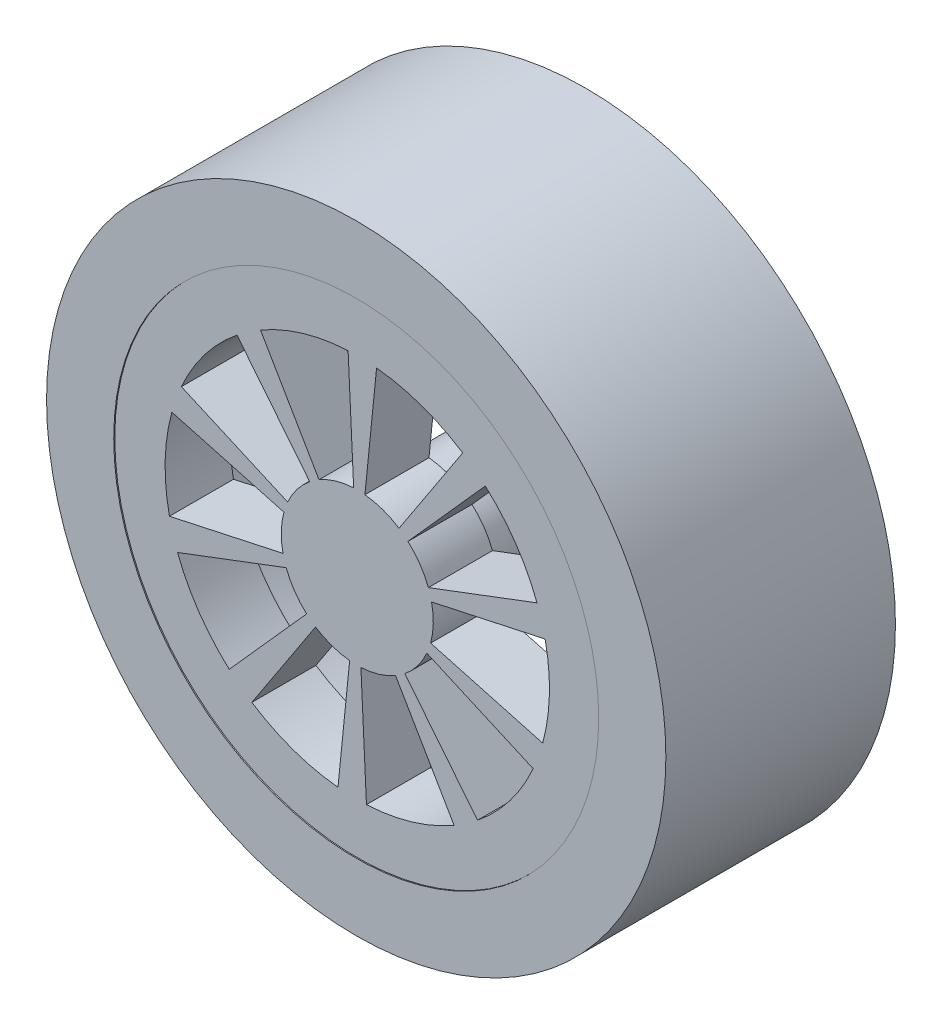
from build123d import *

# Parameters (mm, degrees)
SKETCH2_R           = 14.5
SKETCH2_R_2         = 11.355
BOSS_EXTRUDE1_DEPTH = 10.75
BOSS_EXTRUDE2_START = -0.05
SKETCH6_R           = 11.355
BOSS_EXTRUDE2_DEPTH = 3
CUT_EXTRUDE1_DEPTH  = 3
CIRPATTERN1_COUNT   = 10
SKETCH8_R           = 2.715
SKETCH8_R_2         = 1.025
BOSS_EXTRUDE3_DEPTH = 7.7


with BuildPart() as part:
    # Sketch2 → Boss-Extrude1 (new body)
    with BuildSketch(Plane.XY):
        Circle(SKETCH2_R)
        Circle(SKETCH2_R_2, mode=Mode.SUBTRACT)
    extrude(amount=BOSS_EXTRUDE1_DEPTH)



with BuildPart() as body_2:
    # Sketch6 → Boss-Extrude2 (new body)
    with BuildSketch(Plane.XY.offset(10.75).offset(BOSS_EXTRUDE2_START)):
        Circle(SKETCH6_R)
    extrude(amount=-BOSS_EXTRUDE2_DEPTH)

    # Sketch7 → Cut-Extrude1 (cut)
    with BuildSketch(Plane.XY.offset(10.7)):
        with BuildLine():
            Line((-4.531880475, 7.775735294), (-1.792610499, 3.075735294))
            ThreePointArc((-1.792610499, 3.075735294), (-1.010179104, 3.413669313), (-0.169848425, 3.555945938))
            Line((-0.169848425, 3.555945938), (-0.429392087, 8.989750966))
            ThreePointArc((-0.429392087, 8.989750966), (-2.553823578, 8.630062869), (-4.531880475, 7.775735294))
        make_face()
    cut_extrude1 = extrude(amount=-CUT_EXTRUDE1_DEPTH, mode=Mode.SUBTRACT)

    # CirPattern1: Cut-Extrude1 ×10 about axis
    cirpattern1_axis = Axis((0, 0, 0), (0, 0, 1))
    for i in range(1, CIRPATTERN1_COUNT):
        add(cut_extrude1.rotate(cirpattern1_axis, i * 360 / CIRPATTERN1_COUNT), mode=Mode.SUBTRACT)


with BuildPart() as part_1:
    add(part.part)

    add(body_2.part)  # Boss-Extrude3 merges body 2
    # Sketch8 → Boss-Extrude3 (add)
    with BuildSketch(Plane(origin=(0, 0, 7.7), x_dir=(-1, 0, 0), z_dir=(0, 0, -1))):
        with Locations(Location((0, 0, 0), (0, 0, 180))):
            Circle(SKETCH8_R)
        with Locations(Location((0, 0, 0), (0, 0, 180))):
            Circle(SKETCH8_R_2, mode=Mode.SUBTRACT)
    extrude(amount=BOSS_EXTRUDE3_DEPTH)


solid = part_1.part
